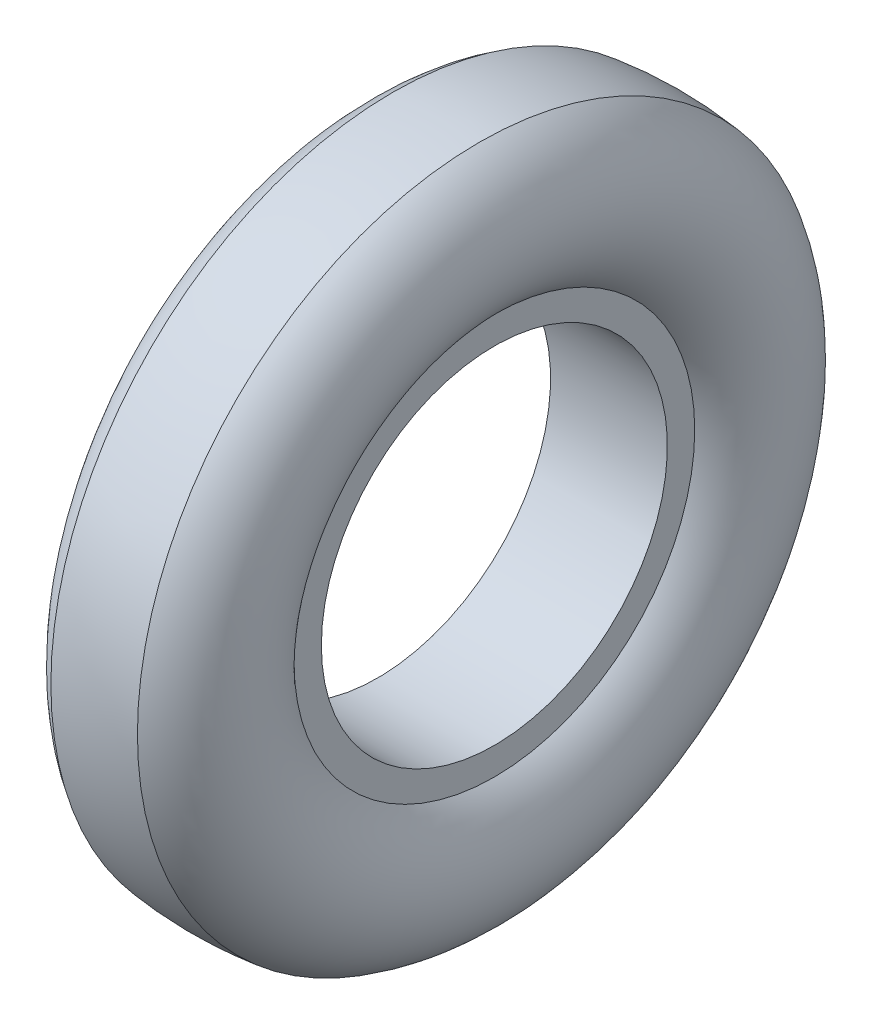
ISO-10303-21;
HEADER;
FILE_DESCRIPTION(('STEP AP214'),'2;1');
FILE_NAME('part.step','',(''),(''),'','','');
FILE_SCHEMA(('AUTOMOTIVE_DESIGN { 1 0 10303 214 1 1 1 1 }'));
ENDSEC;
DATA;
#1=APPLICATION_CONTEXT('core data for automotive mechanical design processes');
#2=APPLICATION_PROTOCOL_DEFINITION('international standard','automotive_design',2000,#1);
#3=PRODUCT_CONTEXT('',#1,'mechanical');
#4=PRODUCT('Part','Part','',(#3));
#5=PRODUCT_RELATED_PRODUCT_CATEGORY('part','',(#4));
#6=PRODUCT_DEFINITION_FORMATION('','',#4);
#7=PRODUCT_DEFINITION_CONTEXT('part definition',#1,'design');
#8=PRODUCT_DEFINITION('design','',#6,#7);
#9=PRODUCT_DEFINITION_SHAPE('','',#8);
#10=(LENGTH_UNIT() NAMED_UNIT(*) SI_UNIT(.MILLI.,.METRE.));
#11=(NAMED_UNIT(*) PLANE_ANGLE_UNIT() SI_UNIT($,.RADIAN.));
#12=(NAMED_UNIT(*) SI_UNIT($,.STERADIAN.) SOLID_ANGLE_UNIT());
#13=UNCERTAINTY_MEASURE_WITH_UNIT(LENGTH_MEASURE(1.E-05),#10,'distance_accuracy_value','');
#14=(GEOMETRIC_REPRESENTATION_CONTEXT(3) GLOBAL_UNCERTAINTY_ASSIGNED_CONTEXT((#13)) GLOBAL_UNIT_ASSIGNED_CONTEXT((#10,
#11,#12)) REPRESENTATION_CONTEXT('',''));
#15=CARTESIAN_POINT('',(0.,0.,0.));
#16=DIRECTION('',(0.,0.,1.));
#17=DIRECTION('',(1.,0.,0.));
#18=AXIS2_PLACEMENT_3D('',#15,#16,#17);
#19=CARTESIAN_POINT('',(0.,0.,0.));
#20=DIRECTION('',(-1.,0.,0.));
#21=DIRECTION('',(0.,0.,1.));
#22=AXIS2_PLACEMENT_3D('',#19,#20,#21);
#23=TOROIDAL_SURFACE('',#22,181.965374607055,60.);
#24=CARTESIAN_POINT('',(29.6440274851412,0.,0.));
#25=DIRECTION('',(-1.,0.,0.));
#26=DIRECTION('',(0.,0.,1.));
#27=AXIS2_PLACEMENT_3D('',#24,#25,#26);
#28=CIRCLE('',#27,234.130800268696);
#29=CARTESIAN_POINT('',(29.6440274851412,234.130800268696,0.));
#30=VERTEX_POINT('',#29);
#31=EDGE_CURVE('E217',#30,#30,#28,.T.);
#32=ORIENTED_EDGE('',*,*,#31,.F.);
#33=EDGE_LOOP('',(#32));
#34=FACE_BOUND('',#33,.T.);
#35=CARTESIAN_POINT('',(40.,0.,0.));
#36=DIRECTION('',(1.,0.,0.));
#37=DIRECTION('',(0.,0.,-1.));
#38=AXIS2_PLACEMENT_3D('',#35,#36,#37);
#39=CIRCLE('',#38,137.24401505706);
#40=CARTESIAN_POINT('',(40.,0.,-137.24401505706));
#41=VERTEX_POINT('',#40);
#42=EDGE_CURVE('E45',#41,#41,#39,.F.);
#43=ORIENTED_EDGE('',*,*,#42,.T.);
#44=EDGE_LOOP('',(#43));
#45=FACE_BOUND('',#44,.T.);
#46=ADVANCED_FACE('F41',(#34,#45),#23,.T.);
#47=CARTESIAN_POINT('',(0.,0.,0.));
#48=DIRECTION('',(-1.,0.,0.));
#49=DIRECTION('',(0.,1.,0.));
#50=AXIS2_PLACEMENT_3D('',#47,#48,#49);
#51=SPHERICAL_SURFACE('',#50,236.);
#52=CARTESIAN_POINT('',(-29.6440274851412,0.,0.));
#53=DIRECTION('',(-1.,0.,0.));
#54=DIRECTION('',(0.,0.,1.));
#55=AXIS2_PLACEMENT_3D('',#52,#53,#54);
#56=CIRCLE('',#55,234.130800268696);
#57=CARTESIAN_POINT('',(-29.6440274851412,234.130800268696,0.));
#58=VERTEX_POINT('',#57);
#59=EDGE_CURVE('E215',#58,#58,#56,.T.);
#60=CARTESIAN_POINT('',(-29.6440274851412,234.130800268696,0.));
#61=CARTESIAN_POINT('',(-29.0297123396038,234.208580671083,0.));
#62=CARTESIAN_POINT('',(-28.4150910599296,234.283943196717,0.));
#63=CARTESIAN_POINT('',(-27.1852743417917,234.429828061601,0.));
#64=CARTESIAN_POINT('',(-26.5700789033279,234.500350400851,0.));
#65=CARTESIAN_POINT('',(-25.3391519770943,234.636550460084,0.));
#66=CARTESIAN_POINT('',(-24.7234204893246,234.702228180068,0.));
#67=CARTESIAN_POINT('',(-23.4914596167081,234.828734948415,0.));
#68=CARTESIAN_POINT('',(-22.8752302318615,234.889563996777,0.));
#69=CARTESIAN_POINT('',(-21.6423117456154,235.006369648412,0.));
#70=CARTESIAN_POINT('',(-21.025622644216,235.062346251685,0.));
#71=CARTESIAN_POINT('',(-19.7918229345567,235.169443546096,0.));
#72=CARTESIAN_POINT('',(-19.1747123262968,235.220564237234,0.));
#73=CARTESIAN_POINT('',(-17.9401078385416,235.317946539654,0.));
#74=CARTESIAN_POINT('',(-17.3226139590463,235.364208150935,0.));
#75=CARTESIAN_POINT('',(-16.0872811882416,235.451869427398,0.));
#76=CARTESIAN_POINT('',(-15.4694422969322,235.493269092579,0.));
#77=CARTESIAN_POINT('',(-14.2334577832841,235.571203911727,0.));
#78=CARTESIAN_POINT('',(-13.6153121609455,235.607739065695,0.));
#79=CARTESIAN_POINT('',(-12.3787524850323,235.675942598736,0.));
#80=CARTESIAN_POINT('',(-11.7603384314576,235.707610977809,0.));
#81=CARTESIAN_POINT('',(-10.5232802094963,235.766078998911,0.));
#82=CARTESIAN_POINT('',(-9.90463604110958,235.792878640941,0.));
#83=CARTESIAN_POINT('',(-8.66715592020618,235.841607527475,0.));
#84=CARTESIAN_POINT('',(-8.04831996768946,235.863536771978,0.));
#85=CARTESIAN_POINT('',(-6.8104946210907,235.90252350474,0.));
#86=CARTESIAN_POINT('',(-6.19150522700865,235.919580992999,0.));
#87=CARTESIAN_POINT('',(-4.95341134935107,235.948823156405,0.));
#88=CARTESIAN_POINT('',(-4.33430686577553,235.961007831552,0.));
#89=CARTESIAN_POINT('',(-3.09602116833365,235.980503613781,0.));
#90=CARTESIAN_POINT('',(-2.4768399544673,235.987814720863,0.));
#91=CARTESIAN_POINT('',(-1.23843916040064,235.997562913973,0.));
#92=CARTESIAN_POINT('',(-0.619219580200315,236.,0.));
#93=CARTESIAN_POINT('',(0.619219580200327,236.,0.));
#94=CARTESIAN_POINT('',(1.23843916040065,235.997562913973,0.));
#95=CARTESIAN_POINT('',(2.47683995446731,235.987814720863,0.));
#96=CARTESIAN_POINT('',(3.09602116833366,235.980503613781,0.));
#97=CARTESIAN_POINT('',(4.33430686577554,235.961007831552,0.));
#98=CARTESIAN_POINT('',(4.95341134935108,235.948823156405,0.));
#99=CARTESIAN_POINT('',(6.19150522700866,235.919580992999,0.));
#100=CARTESIAN_POINT('',(6.81049462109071,235.90252350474,0.));
#101=CARTESIAN_POINT('',(8.04831996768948,235.863536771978,0.));
#102=CARTESIAN_POINT('',(8.66715592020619,235.841607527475,0.));
#103=CARTESIAN_POINT('',(9.90463604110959,235.792878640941,0.));
#104=CARTESIAN_POINT('',(10.5232802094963,235.766078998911,0.));
#105=CARTESIAN_POINT('',(11.7603384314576,235.707610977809,0.));
#106=CARTESIAN_POINT('',(12.3787524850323,235.675942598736,0.));
#107=CARTESIAN_POINT('',(13.6153121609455,235.607739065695,0.));
#108=CARTESIAN_POINT('',(14.2334577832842,235.571203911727,0.));
#109=CARTESIAN_POINT('',(15.4694422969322,235.493269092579,0.));
#110=CARTESIAN_POINT('',(16.0872811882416,235.451869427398,0.));
#111=CARTESIAN_POINT('',(17.3226139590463,235.364208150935,0.));
#112=CARTESIAN_POINT('',(17.9401078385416,235.317946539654,0.));
#113=CARTESIAN_POINT('',(19.1747123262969,235.220564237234,0.));
#114=CARTESIAN_POINT('',(19.7918229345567,235.169443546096,0.));
#115=CARTESIAN_POINT('',(21.025622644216,235.062346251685,0.));
#116=CARTESIAN_POINT('',(21.6423117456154,235.006369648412,0.));
#117=CARTESIAN_POINT('',(22.8752302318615,234.889563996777,0.));
#118=CARTESIAN_POINT('',(23.4914596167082,234.828734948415,0.));
#119=CARTESIAN_POINT('',(24.7234204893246,234.702228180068,0.));
#120=CARTESIAN_POINT('',(25.3391519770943,234.636550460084,0.));
#121=CARTESIAN_POINT('',(26.5700789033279,234.500350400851,0.));
#122=CARTESIAN_POINT('',(27.1852743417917,234.429828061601,0.));
#123=CARTESIAN_POINT('',(28.4150910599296,234.283943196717,0.));
#124=CARTESIAN_POINT('',(29.0297123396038,234.208580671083,0.));
#125=CARTESIAN_POINT('',(29.6440274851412,234.130800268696,0.));
#126=B_SPLINE_CURVE_WITH_KNOTS('',3,(#60,#61,#62,#63,#64,#65,#66,#67,#68,#69,#70,#71,#72,#73,
#74,#75,#76,#77,#78,#79,#80,#81,#82,#83,#84,#85,#86,#87,#88,#89,#90,#91,#92,#93,#94,#95,#96,#97,
#98,#99,#100,#101,#102,#103,#104,#105,#106,#107,#108,#109,#110,#111,#112,#113,#114,#115,#116,
#117,#118,#119,#120,#121,#122,#123,#124,#125),.UNSPECIFIED.,.F.,.F.,(4,2,2,2,2,2,2,2,2,2,2,2,2,
2,2,2,2,2,2,2,2,2,2,2,2,2,2,2,2,2,2,2,4),(0.,1.85765394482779,3.71530788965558,5.57296183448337,
7.43061577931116,9.28826972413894,11.1459236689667,13.0035776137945,14.8612315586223,
16.7188855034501,18.5765394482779,20.4341933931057,22.2918473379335,24.1495012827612,
26.007155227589,27.8648091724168,29.7224631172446,31.5801170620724,33.4377710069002,
35.295424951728,37.1530788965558,39.0107328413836,40.8683867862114,42.7260407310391,
44.5836946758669,46.4413486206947,48.2990025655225,50.1566565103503,52.0143104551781,
53.8719644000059,55.7296183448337,57.5872722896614,59.4449262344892),.UNSPECIFIED.);
#127=EDGE_CURVE('BSEAM92',#58,#30,#126,.T.);
#128=ORIENTED_EDGE('',*,*,#59,.F.);
#129=ORIENTED_EDGE('',*,*,#31,.T.);
#130=ORIENTED_EDGE('',*,*,#127,.T.);
#131=ORIENTED_EDGE('',*,*,#127,.F.);
#132=EDGE_LOOP('',(#128,#130,#129,#131));
#133=FACE_BOUND('',#132,.T.);
#134=ADVANCED_FACE('F92',(#133),#51,.T.);
#135=CARTESIAN_POINT('',(0.,0.,0.));
#136=DIRECTION('',(-1.,0.,0.));
#137=DIRECTION('',(0.,0.,1.));
#138=AXIS2_PLACEMENT_3D('',#135,#136,#137);
#139=TOROIDAL_SURFACE('',#138,181.965374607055,60.);
#140=ORIENTED_EDGE('',*,*,#59,.T.);
#141=EDGE_LOOP('',(#140));
#142=FACE_BOUND('',#141,.T.);
#143=CARTESIAN_POINT('',(-40.,0.,0.));
#144=DIRECTION('',(-1.,0.,0.));
#145=DIRECTION('',(0.,0.,1.));
#146=AXIS2_PLACEMENT_3D('',#143,#144,#145);
#147=CIRCLE('',#146,137.24401505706);
#148=CARTESIAN_POINT('',(-40.,0.,137.24401505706));
#149=VERTEX_POINT('',#148);
#150=EDGE_CURVE('E71',#149,#149,#147,.F.);
#151=ORIENTED_EDGE('',*,*,#150,.T.);
#152=EDGE_LOOP('',(#151));
#153=FACE_BOUND('',#152,.T.);
#154=ADVANCED_FACE('F82',(#142,#153),#139,.T.);
#155=CARTESIAN_POINT('',(40.,118.5,0.));
#156=DIRECTION('',(-1.,0.,0.));
#157=DIRECTION('',(0.,0.,1.));
#158=AXIS2_PLACEMENT_3D('',#155,#156,#157);
#159=PLANE('',#158);
#160=CARTESIAN_POINT('',(40.,0.,0.));
#161=DIRECTION('',(-1.,0.,0.));
#162=DIRECTION('',(0.,0.,1.));
#163=AXIS2_PLACEMENT_3D('',#160,#161,#162);
#164=CIRCLE('',#163,118.5);
#165=CARTESIAN_POINT('',(40.,0.,118.5));
#166=VERTEX_POINT('',#165);
#167=EDGE_CURVE('E63',#166,#166,#164,.T.);
#168=ORIENTED_EDGE('',*,*,#167,.T.);
#169=EDGE_LOOP('',(#168));
#170=FACE_BOUND('',#169,.T.);
#171=ORIENTED_EDGE('',*,*,#42,.F.);
#172=EDGE_LOOP('',(#171));
#173=FACE_BOUND('',#172,.T.);
#174=ADVANCED_FACE('F79',(#170,#173),#159,.F.);
#175=CARTESIAN_POINT('',(-100.,0.,0.));
#176=DIRECTION('',(-1.,0.,0.));
#177=DIRECTION('',(0.,0.,1.));
#178=AXIS2_PLACEMENT_3D('',#175,#176,#177);
#179=CYLINDRICAL_SURFACE('',#178,118.5);
#180=ORIENTED_EDGE('',*,*,#167,.F.);
#181=EDGE_LOOP('',(#180));
#182=FACE_BOUND('',#181,.T.);
#183=CARTESIAN_POINT('',(-40.,0.,0.));
#184=DIRECTION('',(-1.,0.,0.));
#185=DIRECTION('',(0.,0.,1.));
#186=AXIS2_PLACEMENT_3D('',#183,#184,#185);
#187=CIRCLE('',#186,118.5);
#188=CARTESIAN_POINT('',(-40.,0.,118.5));
#189=VERTEX_POINT('',#188);
#190=EDGE_CURVE('E60',#189,#189,#187,.T.);
#191=ORIENTED_EDGE('',*,*,#190,.T.);
#192=EDGE_LOOP('',(#191));
#193=FACE_BOUND('',#192,.T.);
#194=ADVANCED_FACE('F81',(#182,#193),#179,.F.);
#195=CARTESIAN_POINT('',(-40.,118.5,0.));
#196=DIRECTION('',(1.,0.,0.));
#197=DIRECTION('',(0.,0.,-1.));
#198=AXIS2_PLACEMENT_3D('',#195,#196,#197);
#199=PLANE('',#198);
#200=ORIENTED_EDGE('',*,*,#190,.F.);
#201=EDGE_LOOP('',(#200));
#202=FACE_BOUND('',#201,.T.);
#203=ORIENTED_EDGE('',*,*,#150,.F.);
#204=EDGE_LOOP('',(#203));
#205=FACE_BOUND('',#204,.T.);
#206=ADVANCED_FACE('F89',(#202,#205),#199,.F.);
#207=CLOSED_SHELL('',(#46,#134,#154,#174,#194,#206));
#208=CARTESIAN_POINT('',(-33.,138.5,0.));
#209=DIRECTION('',(-1.,0.,0.));
#210=DIRECTION('',(0.,0.,1.));
#211=AXIS2_PLACEMENT_3D('',#208,#209,#210);
#212=PLANE('',#211);
#213=CARTESIAN_POINT('',(-33.,0.,0.));
#214=DIRECTION('',(-1.,0.,0.));
#215=DIRECTION('',(0.,0.,1.));
#216=AXIS2_PLACEMENT_3D('',#213,#214,#215);
#217=CIRCLE('',#216,123.5);
#218=CARTESIAN_POINT('',(-33.,0.,123.5));
#219=VERTEX_POINT('',#218);
#220=EDGE_CURVE('E69',#219,#219,#217,.T.);
#221=ORIENTED_EDGE('',*,*,#220,.T.);
#222=EDGE_LOOP('',(#221));
#223=FACE_BOUND('',#222,.T.);
#224=CARTESIAN_POINT('',(-33.,0.,0.));
#225=DIRECTION('',(1.,0.,0.));
#226=DIRECTION('',(0.,0.,-1.));
#227=AXIS2_PLACEMENT_3D('',#224,#225,#226);
#228=CIRCLE('',#227,131.855495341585);
#229=CARTESIAN_POINT('',(-33.,0.,-131.855495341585));
#230=VERTEX_POINT('',#229);
#231=EDGE_CURVE('E11',#230,#230,#228,.F.);
#232=ORIENTED_EDGE('',*,*,#231,.F.);
#233=EDGE_LOOP('',(#232));
#234=FACE_BOUND('',#233,.T.);
#235=ADVANCED_FACE('F43',(#223,#234),#212,.F.);
#236=CARTESIAN_POINT('',(33.,138.5,0.));
#237=DIRECTION('',(1.,0.,0.));
#238=DIRECTION('',(0.,0.,-1.));
#239=AXIS2_PLACEMENT_3D('',#236,#237,#238);
#240=PLANE('',#239);
#241=CARTESIAN_POINT('',(33.,0.,0.));
#242=DIRECTION('',(-1.,0.,0.));
#243=DIRECTION('',(0.,0.,1.));
#244=AXIS2_PLACEMENT_3D('',#241,#242,#243);
#245=CIRCLE('',#244,123.5);
#246=CARTESIAN_POINT('',(33.,0.,123.5));
#247=VERTEX_POINT('',#246);
#248=EDGE_CURVE('E66',#247,#247,#245,.T.);
#249=ORIENTED_EDGE('',*,*,#248,.F.);
#250=EDGE_LOOP('',(#249));
#251=FACE_BOUND('',#250,.T.);
#252=CARTESIAN_POINT('',(33.,0.,0.));
#253=DIRECTION('',(-1.,0.,0.));
#254=DIRECTION('',(0.,0.,1.));
#255=AXIS2_PLACEMENT_3D('',#252,#253,#254);
#256=CIRCLE('',#255,131.855495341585);
#257=CARTESIAN_POINT('',(33.,0.,131.855495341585));
#258=VERTEX_POINT('',#257);
#259=EDGE_CURVE('E50',#258,#258,#256,.F.);
#260=ORIENTED_EDGE('',*,*,#259,.F.);
#261=EDGE_LOOP('',(#260));
#262=FACE_BOUND('',#261,.T.);
#263=ADVANCED_FACE('F118',(#251,#262),#240,.F.);
#264=CARTESIAN_POINT('',(-100.,0.,0.));
#265=DIRECTION('',(-1.,0.,0.));
#266=DIRECTION('',(0.,0.,1.));
#267=AXIS2_PLACEMENT_3D('',#264,#265,#266);
#268=CYLINDRICAL_SURFACE('',#267,123.5);
#269=ORIENTED_EDGE('',*,*,#220,.F.);
#270=EDGE_LOOP('',(#269));
#271=FACE_BOUND('',#270,.T.);
#272=ORIENTED_EDGE('',*,*,#248,.T.);
#273=EDGE_LOOP('',(#272));
#274=FACE_BOUND('',#273,.T.);
#275=ADVANCED_FACE('F109',(#271,#274),#268,.T.);
#276=CARTESIAN_POINT('',(29.9933299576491,0.,0.));
#277=DIRECTION('',(-1.,0.,0.));
#278=DIRECTION('',(0.,0.,1.));
#279=AXIS2_PLACEMENT_3D('',#276,#277,#278);
#280=CIRCLE('',#279,130.);
#281=CARTESIAN_POINT('',(29.9933299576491,0.,130.));
#282=VERTEX_POINT('',#281);
#283=EDGE_CURVE('E222',#282,#282,#280,.T.);
#284=ORIENTED_EDGE('',*,*,#283,.T.);
#285=EDGE_LOOP('',(#284));
#286=FACE_BOUND('',#285,.T.);
#287=ORIENTED_EDGE('',*,*,#259,.T.);
#288=EDGE_LOOP('',(#287));
#289=FACE_BOUND('',#288,.T.);
#290=ADVANCED_FACE('F100',(#286,#289),#23,.T.);
#291=CARTESIAN_POINT('',(-29.9933299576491,0.,0.));
#292=DIRECTION('',(-1.,0.,0.));
#293=DIRECTION('',(0.,0.,1.));
#294=AXIS2_PLACEMENT_3D('',#291,#292,#293);
#295=CIRCLE('',#294,130.);
#296=CARTESIAN_POINT('',(-29.9933299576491,0.,130.));
#297=VERTEX_POINT('',#296);
#298=EDGE_CURVE('E224',#297,#297,#295,.T.);
#299=ORIENTED_EDGE('',*,*,#298,.F.);
#300=EDGE_LOOP('',(#299));
#301=FACE_BOUND('',#300,.T.);
#302=ORIENTED_EDGE('',*,*,#231,.T.);
#303=EDGE_LOOP('',(#302));
#304=FACE_BOUND('',#303,.T.);
#305=ADVANCED_FACE('F95',(#301,#304),#139,.T.);
#306=CARTESIAN_POINT('',(0.,0.,0.));
#307=DIRECTION('',(-1.,0.,0.));
#308=DIRECTION('',(0.,0.,1.));
#309=AXIS2_PLACEMENT_3D('',#306,#307,#308);
#310=CYLINDRICAL_SURFACE('',#309,130.);
#311=ORIENTED_EDGE('',*,*,#283,.F.);
#312=EDGE_LOOP('',(#311));
#313=FACE_BOUND('',#312,.T.);
#314=ORIENTED_EDGE('',*,*,#298,.T.);
#315=EDGE_LOOP('',(#314));
#316=FACE_BOUND('',#315,.T.);
#317=ADVANCED_FACE('F116',(#313,#316),#310,.F.);
#318=CLOSED_SHELL('',(#235,#263,#275,#290,#305,#317));
#319=CARTESIAN_POINT('',(0.,0.,0.));
#320=DIRECTION('',(-1.,0.,0.));
#321=DIRECTION('',(0.,0.,1.));
#322=AXIS2_PLACEMENT_3D('',#319,#320,#321);
#323=TOROIDAL_SURFACE('',#322,181.965374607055,50.);
#324=CARTESIAN_POINT('',(-35.7071421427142,0.,0.));
#325=DIRECTION('',(-1.,0.,0.));
#326=DIRECTION('',(0.,0.,1.));
#327=AXIS2_PLACEMENT_3D('',#324,#325,#326);
#328=CIRCLE('',#327,146.965374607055);
#329=CARTESIAN_POINT('',(-35.7071421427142,0.,146.965374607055));
#330=VERTEX_POINT('',#329);
#331=EDGE_CURVE('E57',#330,#330,#328,.T.);
#332=ORIENTED_EDGE('',*,*,#331,.T.);
#333=EDGE_LOOP('',(#332));
#334=FACE_BOUND('',#333,.T.);
#335=CARTESIAN_POINT('',(35.7071421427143,0.,0.));
#336=DIRECTION('',(-1.,0.,0.));
#337=DIRECTION('',(0.,0.,1.));
#338=AXIS2_PLACEMENT_3D('',#335,#336,#337);
#339=CIRCLE('',#338,146.965374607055);
#340=CARTESIAN_POINT('',(35.7071421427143,0.,146.965374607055));
#341=VERTEX_POINT('',#340);
#342=EDGE_CURVE('E212',#341,#341,#339,.T.);
#343=ORIENTED_EDGE('',*,*,#342,.F.);
#344=EDGE_LOOP('',(#343));
#345=FACE_BOUND('',#344,.T.);
#346=ADVANCED_FACE('F198',(#334,#345),#323,.F.);
#347=CARTESIAN_POINT('',(0.,0.,0.));
#348=DIRECTION('',(-1.,0.,0.));
#349=DIRECTION('',(0.,0.,1.));
#350=AXIS2_PLACEMENT_3D('',#347,#348,#349);
#351=CYLINDRICAL_SURFACE('',#350,146.965374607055);
#352=ORIENTED_EDGE('',*,*,#342,.T.);
#353=EDGE_LOOP('',(#352));
#354=FACE_BOUND('',#353,.T.);
#355=ORIENTED_EDGE('',*,*,#331,.F.);
#356=EDGE_LOOP('',(#355));
#357=FACE_BOUND('',#356,.T.);
#358=ADVANCED_FACE('F201',(#354,#357),#351,.T.);
#359=CLOSED_SHELL('',(#346,#358));
#360=ORIENTED_CLOSED_SHELL('',*,#318,.T.);
#361=ORIENTED_CLOSED_SHELL('',*,#359,.T.);
#362=BREP_WITH_VOIDS('B2',#207,(#360,#361));
#363=ADVANCED_BREP_SHAPE_REPRESENTATION('',(#18,#362),#14);
#364=SHAPE_DEFINITION_REPRESENTATION(#9,#363);
ENDSEC;
END-ISO-10303-21;
